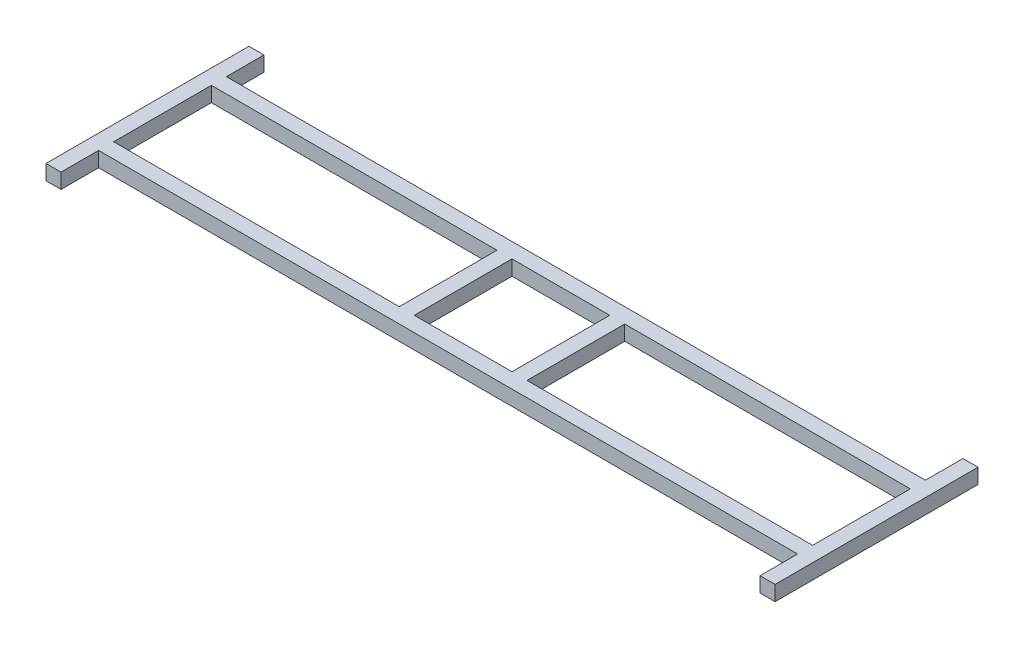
from build123d import *

# Parameters (mm, degrees)
SKETCH1_W           = 260
SKETCH1_H           = 260
SKETCH1_W_2         = 760
BOSS_EXTRUDE1_DEPTH = 40
SCALE1_SCALE        = 2.5


with BuildPart() as part:
    # Sketch1 → Boss-Extrude1 (new body)
    with BuildSketch(Plane(origin=(0, 0, 0), x_dir=(1, 0, 0), z_dir=(0, 1, 0))):
        Polygon((1920, -270), (1880, -270), (1880, -170), (20, -170), (20, -270), (-20, -270), (-20, -150), (-20, 150), (-20, 270), (20, 270), (20, 170), (1880, 170), (1880, 270), (1920, 270), (1920, 150), (1920, -150), align=None)
        with Locations((950, 0)):
            Rectangle(SKETCH1_W, SKETCH1_H, mode=Mode.SUBTRACT)
        with Locations((400, 0)):
            Rectangle(SKETCH1_W_2, SKETCH1_H, mode=Mode.SUBTRACT)
        with Locations((1500, 0)):
            Rectangle(SKETCH1_W_2, SKETCH1_H, mode=Mode.SUBTRACT)
    extrude(amount=BOSS_EXTRUDE1_DEPTH)


with BuildPart() as part_1:
    # Scale1: scaled about (950, 20, 0)
    add(part.part.scale(SCALE1_SCALE).moved(Location((-1425, -30, 0))))


solid = part_1.part
